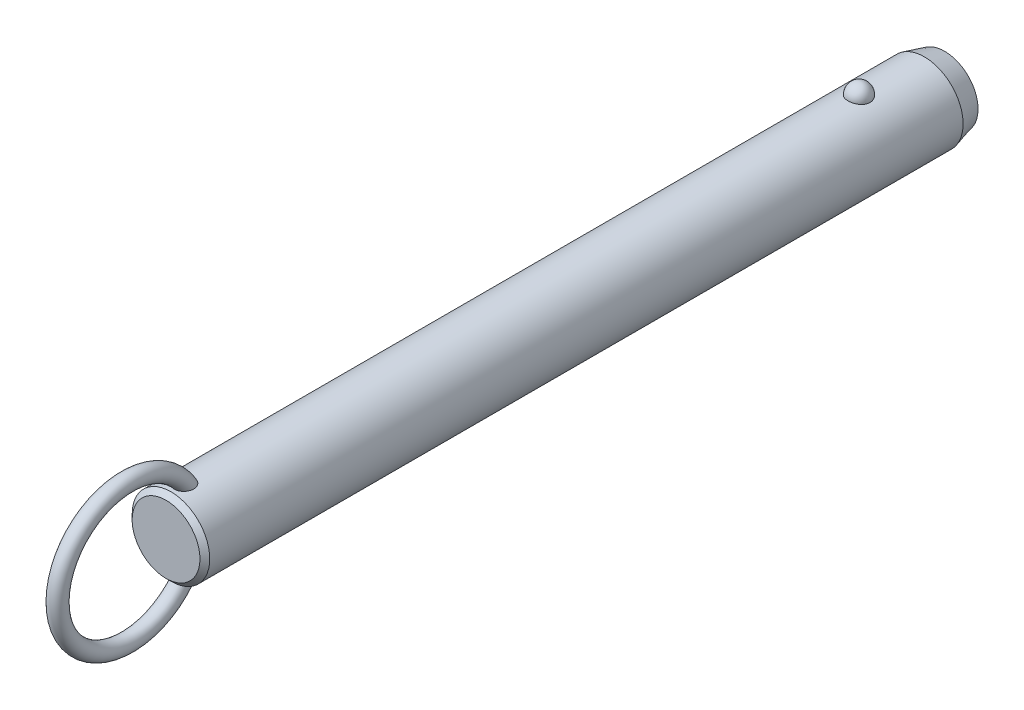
ISO-10303-21;
HEADER;
FILE_DESCRIPTION(('STEP AP214'),'2;1');
FILE_NAME('part.step','',(''),(''),'','','');
FILE_SCHEMA(('AUTOMOTIVE_DESIGN { 1 0 10303 214 1 1 1 1 }'));
ENDSEC;
DATA;
#1=APPLICATION_CONTEXT('core data for automotive mechanical design processes');
#2=APPLICATION_PROTOCOL_DEFINITION('international standard','automotive_design',2000,#1);
#3=PRODUCT_CONTEXT('',#1,'mechanical');
#4=PRODUCT('Part','Part','',(#3));
#5=PRODUCT_RELATED_PRODUCT_CATEGORY('part','',(#4));
#6=PRODUCT_DEFINITION_FORMATION('','',#4);
#7=PRODUCT_DEFINITION_CONTEXT('part definition',#1,'design');
#8=PRODUCT_DEFINITION('design','',#6,#7);
#9=PRODUCT_DEFINITION_SHAPE('','',#8);
#10=(LENGTH_UNIT() NAMED_UNIT(*) SI_UNIT(.MILLI.,.METRE.));
#11=(NAMED_UNIT(*) PLANE_ANGLE_UNIT() SI_UNIT($,.RADIAN.));
#12=(NAMED_UNIT(*) SI_UNIT($,.STERADIAN.) SOLID_ANGLE_UNIT());
#13=UNCERTAINTY_MEASURE_WITH_UNIT(LENGTH_MEASURE(1.E-05),#10,'distance_accuracy_value','');
#14=(GEOMETRIC_REPRESENTATION_CONTEXT(3) GLOBAL_UNCERTAINTY_ASSIGNED_CONTEXT((#13)) GLOBAL_UNIT_ASSIGNED_CONTEXT((#10,
#11,#12)) REPRESENTATION_CONTEXT('',''));
#15=CARTESIAN_POINT('',(0.,0.,0.));
#16=DIRECTION('',(0.,0.,1.));
#17=DIRECTION('',(1.,0.,0.));
#18=AXIS2_PLACEMENT_3D('',#15,#16,#17);
#19=CARTESIAN_POINT('',(0.,0.,157.5));
#20=DIRECTION('',(0.,0.,-1.));
#21=DIRECTION('',(-1.,0.,0.));
#22=AXIS2_PLACEMENT_3D('',#19,#20,#21);
#23=CYLINDRICAL_SURFACE('',#22,9.5);
#24=CARTESIAN_POINT('',(2.67259918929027,9.11631578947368,-2.70000000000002));
#25=CARTESIAN_POINT('',(2.6725968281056,9.11631786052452,-2.54909854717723));
#26=CARTESIAN_POINT('',(2.66030567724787,9.11994722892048,-2.39816735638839));
#27=CARTESIAN_POINT('',(2.6114347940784,9.13405924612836,-2.10058568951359));
#28=CARTESIAN_POINT('',(2.57484658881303,9.14454428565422,-1.95393672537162));
#29=CARTESIAN_POINT('',(2.47830875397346,9.17117631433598,-1.66916069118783));
#30=CARTESIAN_POINT('',(2.41836936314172,9.18732082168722,-1.53102991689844));
#31=CARTESIAN_POINT('',(2.27661331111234,9.22346780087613,-1.26705393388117));
#32=CARTESIAN_POINT('',(2.19479699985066,9.24347021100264,-1.14120852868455));
#33=CARTESIAN_POINT('',(2.01085282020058,9.28522401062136,-0.904632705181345));
#34=CARTESIAN_POINT('',(1.90862396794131,9.30698376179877,-0.793982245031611));
#35=CARTESIAN_POINT('',(1.6867437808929,9.34973971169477,-0.59160721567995));
#36=CARTESIAN_POINT('',(1.56709244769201,9.37073591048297,-0.499882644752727));
#37=CARTESIAN_POINT('',(1.31393976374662,9.40956370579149,-0.338167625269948));
#38=CARTESIAN_POINT('',(1.18048026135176,9.42740444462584,-0.268113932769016));
#39=CARTESIAN_POINT('',(0.903154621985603,9.45799906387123,-0.151390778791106));
#40=CARTESIAN_POINT('',(0.759289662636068,9.47075351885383,-0.104718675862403));
#41=CARTESIAN_POINT('',(0.468074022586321,9.48956256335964,-0.0367633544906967));
#42=CARTESIAN_POINT('',(0.320836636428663,9.49573643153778,-0.0150275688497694));
#43=CARTESIAN_POINT('',(0.0246714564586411,9.50112183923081,0.00396199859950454));
#44=CARTESIAN_POINT('',(-0.124256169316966,9.50033406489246,0.00121819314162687));
#45=CARTESIAN_POINT('',(-0.417264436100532,9.4919475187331,-0.0284441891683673));
#46=CARTESIAN_POINT('',(-0.56138413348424,9.48444885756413,-0.0550074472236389));
#47=CARTESIAN_POINT('',(-0.842986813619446,9.46357853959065,-0.131064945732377));
#48=CARTESIAN_POINT('',(-0.980469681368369,9.450206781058,-0.180559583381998));
#49=CARTESIAN_POINT('',(-1.24585005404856,9.41890822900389,-0.301476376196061));
#50=CARTESIAN_POINT('',(-1.37368611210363,9.40095498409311,-0.373026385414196));
#51=CARTESIAN_POINT('',(-1.61552738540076,9.36242964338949,-0.536025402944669));
#52=CARTESIAN_POINT('',(-1.72953116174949,9.34185727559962,-0.627476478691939));
#53=CARTESIAN_POINT('',(-1.9429225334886,9.29984568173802,-0.829844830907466));
#54=CARTESIAN_POINT('',(-2.04198021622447,9.27839736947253,-0.941108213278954));
#55=CARTESIAN_POINT('',(-2.22026460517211,9.23735994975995,-1.17883414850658));
#56=CARTESIAN_POINT('',(-2.29948985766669,9.21777097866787,-1.30529781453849));
#57=CARTESIAN_POINT('',(-2.43697287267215,9.18238994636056,-1.57158566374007));
#58=CARTESIAN_POINT('',(-2.49497068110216,9.16664569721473,-1.71155057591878));
#59=CARTESIAN_POINT('',(-2.5872073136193,9.14104303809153,-1.99961197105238));
#60=CARTESIAN_POINT('',(-2.62144683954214,9.13118445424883,-2.1477082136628));
#61=CARTESIAN_POINT('',(-2.66521466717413,9.11850622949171,-2.44715424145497));
#62=CARTESIAN_POINT('',(-2.67484831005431,9.11565658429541,-2.59848735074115));
#63=CARTESIAN_POINT('',(-2.66946735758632,9.11723375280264,-2.90067317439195));
#64=CARTESIAN_POINT('',(-2.65445345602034,9.12166036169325,-3.05152590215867));
#65=CARTESIAN_POINT('',(-2.60029711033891,9.13724422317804,-3.34766110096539));
#66=CARTESIAN_POINT('',(-2.56127978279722,9.14836656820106,-3.49296833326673));
#67=CARTESIAN_POINT('',(-2.46018844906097,9.17606676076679,-3.77477535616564));
#68=CARTESIAN_POINT('',(-2.39811349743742,9.1926448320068,-3.91127478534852));
#69=CARTESIAN_POINT('',(-2.25202303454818,9.22952198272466,-4.17244273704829));
#70=CARTESIAN_POINT('',(-2.16788714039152,9.24984129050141,-4.29704106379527));
#71=CARTESIAN_POINT('',(-1.9799408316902,9.29188255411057,-4.53013066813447));
#72=CARTESIAN_POINT('',(-1.87612963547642,9.31360456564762,-4.63862130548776));
#73=CARTESIAN_POINT('',(-1.65105429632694,9.35612959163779,-4.83690299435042));
#74=CARTESIAN_POINT('',(-1.52972405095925,9.37692871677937,-4.9266199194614));
#75=CARTESIAN_POINT('',(-1.27318250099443,9.41518970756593,-5.08429106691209));
#76=CARTESIAN_POINT('',(-1.13797219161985,9.432651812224,-5.15224684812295));
#77=CARTESIAN_POINT('',(-0.859280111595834,9.46208255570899,-5.26371827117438));
#78=CARTESIAN_POINT('',(-0.715925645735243,9.47411833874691,-5.30753421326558));
#79=CARTESIAN_POINT('',(-0.423550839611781,9.4916822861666,-5.37076321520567));
#80=CARTESIAN_POINT('',(-0.2745312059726,9.49721125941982,-5.39017930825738));
#81=CARTESIAN_POINT('',(0.0218446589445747,9.50110860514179,-5.40390587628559));
#82=CARTESIAN_POINT('',(0.16917707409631,9.49961381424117,-5.39869609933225));
#83=CARTESIAN_POINT('',(0.460808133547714,9.48993906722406,-5.36441955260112));
#84=CARTESIAN_POINT('',(0.605106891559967,9.48175936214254,-5.33535367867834));
#85=CARTESIAN_POINT('',(0.886027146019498,9.4596376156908,-5.25435587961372));
#86=CARTESIAN_POINT('',(1.02267710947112,9.44571881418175,-5.20251612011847));
#87=CARTESIAN_POINT('',(1.28523827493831,9.41358993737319,-5.07741549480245));
#88=CARTESIAN_POINT('',(1.41114877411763,9.39537958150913,-5.00415322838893));
#89=CARTESIAN_POINT('',(1.65085227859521,9.3562644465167,-4.83684599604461));
#90=CARTESIAN_POINT('',(1.76442346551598,9.33532178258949,-4.74249218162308));
#91=CARTESIAN_POINT('',(1.97425672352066,9.29321198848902,-4.53620389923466));
#92=CARTESIAN_POINT('',(2.07051582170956,9.27204482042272,-4.42426641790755));
#93=CARTESIAN_POINT('',(2.24490086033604,9.23139221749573,-4.18363183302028));
#94=CARTESIAN_POINT('',(2.32267019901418,9.21194380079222,-4.05466990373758));
#95=CARTESIAN_POINT('',(2.45584092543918,9.1773419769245,-3.78517836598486));
#96=CARTESIAN_POINT('',(2.5112497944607,9.16218713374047,-3.644652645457));
#97=CARTESIAN_POINT('',(2.59380876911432,9.13913522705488,-3.37104301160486));
#98=CARTESIAN_POINT('',(2.62330266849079,9.13064624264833,-3.23871053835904));
#99=CARTESIAN_POINT('',(2.66269870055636,9.11923566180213,-2.97092664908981));
#100=CARTESIAN_POINT('',(2.67260130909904,9.11631393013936,-2.83547530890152));
#101=CARTESIAN_POINT('',(2.67259918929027,9.11631578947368,-2.70000000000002));
#102=B_SPLINE_CURVE_WITH_KNOTS('',3,(#24,#25,#26,#27,#28,#29,#30,#31,#32,#33,#34,#35,#36,#37,
#38,#39,#40,#41,#42,#43,#44,#45,#46,#47,#48,#49,#50,#51,#52,#53,#54,#55,#56,#57,#58,#59,#60,#61,
#62,#63,#64,#65,#66,#67,#68,#69,#70,#71,#72,#73,#74,#75,#76,#77,#78,#79,#80,#81,#82,#83,#84,#85,
#86,#87,#88,#89,#90,#91,#92,#93,#94,#95,#96,#97,#98,#99,#100,#101),.UNSPECIFIED.,.T.,.F.,(4,2,2,
2,2,2,2,2,2,2,2,2,2,2,2,2,2,2,2,2,2,2,2,2,2,2,2,2,2,2,2,2,2,2,2,2,2,2,4),(0.,0.452217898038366,
0.904593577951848,1.35677112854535,1.80894144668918,2.26340676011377,2.71787203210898,
3.17099820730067,3.62407318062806,4.0687883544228,4.51345969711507,4.95160616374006,
5.38976021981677,5.83050358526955,6.27129275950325,6.72071308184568,7.17016633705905,
7.62495278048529,8.07972578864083,8.53254856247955,8.98535859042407,9.43582813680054,
9.88631615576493,10.3393155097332,10.7923328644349,11.2471065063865,11.7018475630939,
12.150795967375,12.599688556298,13.0398725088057,13.4800399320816,13.9184421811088,
14.3568730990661,14.802202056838,15.2476074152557,15.7010097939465,16.1542603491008,
16.5602594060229,16.966248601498),.UNSPECIFIED.);
#103=CARTESIAN_POINT('',(2.67259918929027,9.11631578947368,-2.70000000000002));
#104=VERTEX_POINT('',#103);
#105=EDGE_CURVE('E41',#104,#104,#102,.T.);
#106=ORIENTED_EDGE('',*,*,#105,.T.);
#107=EDGE_LOOP('',(#106));
#108=FACE_BOUND('',#107,.T.);
#109=CARTESIAN_POINT('',(0.,0.,165.82));
#110=DIRECTION('',(0.,0.,1.));
#111=DIRECTION('',(1.,0.,0.));
#112=AXIS2_PLACEMENT_3D('',#109,#110,#111);
#113=CIRCLE('',#112,9.5);
#114=CARTESIAN_POINT('',(9.5,0.,165.82));
#115=VERTEX_POINT('',#114);
#116=EDGE_CURVE('E10',#115,#115,#113,.F.);
#117=ORIENTED_EDGE('',*,*,#116,.T.);
#118=EDGE_LOOP('',(#117));
#119=FACE_BOUND('',#118,.T.);
#120=CARTESIAN_POINT('',(-0.697062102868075,-9.47439269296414,160.167808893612));
#121=CARTESIAN_POINT('',(-0.799579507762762,-9.46685146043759,160.207482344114));
#122=CARTESIAN_POINT('',(-0.89857563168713,-9.45788043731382,160.2559309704));
#123=CARTESIAN_POINT('',(-1.08670047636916,-9.43811593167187,160.368868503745));
#124=CARTESIAN_POINT('',(-1.17583204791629,-9.42732297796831,160.433352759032));
#125=CARTESIAN_POINT('',(-1.34179806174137,-9.40513672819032,160.576209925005));
#126=CARTESIAN_POINT('',(-1.41865133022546,-9.39374438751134,160.654561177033));
#127=CARTESIAN_POINT('',(-1.5586004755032,-9.37154196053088,160.822752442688));
#128=CARTESIAN_POINT('',(-1.62169476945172,-9.3607319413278,160.91259377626));
#129=CARTESIAN_POINT('',(-1.73527695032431,-9.34035749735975,161.104500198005));
#130=CARTESIAN_POINT('',(-1.78522266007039,-9.33085270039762,161.206891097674));
#131=CARTESIAN_POINT('',(-1.86924997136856,-9.3143834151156,161.418148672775));
#132=CARTESIAN_POINT('',(-1.90332570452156,-9.30741986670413,161.527017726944));
#133=CARTESIAN_POINT('',(-1.95893603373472,-9.29588482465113,161.760473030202));
#134=CARTESIAN_POINT('',(-1.97872420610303,-9.29165182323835,161.885489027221));
#135=CARTESIAN_POINT('',(-2.00062129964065,-9.28695978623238,162.137080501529));
#136=CARTESIAN_POINT('',(-2.00272284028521,-9.28650232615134,162.263656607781));
#137=CARTESIAN_POINT('',(-1.98958876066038,-9.28932750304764,162.536815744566));
#138=CARTESIAN_POINT('',(-1.97143366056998,-9.2932400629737,162.683251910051));
#139=CARTESIAN_POINT('',(-1.91479925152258,-9.30507151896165,162.972062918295));
#140=CARTESIAN_POINT('',(-1.87629122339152,-9.31299607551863,163.114431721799));
#141=CARTESIAN_POINT('',(-1.7722568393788,-9.33340232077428,163.415172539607));
#142=CARTESIAN_POINT('',(-1.70334898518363,-9.34641636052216,163.572369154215));
#143=CARTESIAN_POINT('',(-1.58111062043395,-9.36759153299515,163.797517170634));
#144=CARTESIAN_POINT('',(-1.53721459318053,-9.3749261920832,163.870796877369));
#145=CARTESIAN_POINT('',(-1.44302631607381,-9.38988566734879,164.01307405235));
#146=CARTESIAN_POINT('',(-1.39273721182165,-9.39751033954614,164.082073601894));
#147=CARTESIAN_POINT('',(-1.26775962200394,-9.41530678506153,164.236983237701));
#148=CARTESIAN_POINT('',(-1.19052326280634,-9.42548108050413,164.320871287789));
#149=CARTESIAN_POINT('',(-1.0242024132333,-9.44499825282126,164.476008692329));
#150=CARTESIAN_POINT('',(-0.935139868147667,-9.45434261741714,164.547280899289));
#151=CARTESIAN_POINT('',(-0.766610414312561,-9.46930670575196,164.658695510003));
#152=CARTESIAN_POINT('',(-0.689439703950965,-9.47529223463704,164.702235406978));
#153=CARTESIAN_POINT('',(-0.52894200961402,-9.48560294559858,164.77631336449));
#154=CARTESIAN_POINT('',(-0.445620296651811,-9.48992953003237,164.806862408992));
#155=CARTESIAN_POINT('',(-0.273901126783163,-9.49644161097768,164.852579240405));
#156=CARTESIAN_POINT('',(-0.18546574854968,-9.49860811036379,164.86761059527));
#157=CARTESIAN_POINT('',(-0.00734541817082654,-9.5004135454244,164.880149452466));
#158=CARTESIAN_POINT('',(0.082338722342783,-9.50005405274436,164.877667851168));
#159=CARTESIAN_POINT('',(0.247679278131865,-9.49708301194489,164.856995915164));
#160=CARTESIAN_POINT('',(0.323620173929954,-9.49477609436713,164.840930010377));
#161=CARTESIAN_POINT('',(0.471981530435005,-9.48855917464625,164.797172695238));
#162=CARTESIAN_POINT('',(0.544400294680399,-9.48464840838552,164.769475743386));
#163=CARTESIAN_POINT('',(0.708947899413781,-9.47398336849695,164.69280266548));
#164=CARTESIAN_POINT('',(0.799149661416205,-9.46671310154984,164.639774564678));
#165=CARTESIAN_POINT('',(0.969783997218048,-9.45076225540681,164.519973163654));
#166=CARTESIAN_POINT('',(1.05019415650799,-9.44207854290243,164.453169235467));
#167=CARTESIAN_POINT('',(1.23092343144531,-9.42051459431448,164.280759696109));
#168=CARTESIAN_POINT('',(1.32652499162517,-9.40733378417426,164.17026193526));
#169=CARTESIAN_POINT('',(1.49893121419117,-9.38140745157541,163.935561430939));
#170=CARTESIAN_POINT('',(1.57571616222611,-9.36866239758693,163.811344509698));
#171=CARTESIAN_POINT('',(1.71285426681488,-9.34457644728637,163.549389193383));
#172=CARTESIAN_POINT('',(1.77266365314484,-9.33328726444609,163.41136233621));
#173=CARTESIAN_POINT('',(1.87239208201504,-9.31379209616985,163.128051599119));
#174=CARTESIAN_POINT('',(1.91230158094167,-9.30558759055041,162.982764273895));
#175=CARTESIAN_POINT('',(1.97604189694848,-9.29228394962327,162.662028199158));
#176=CARTESIAN_POINT('',(1.9958743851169,-9.28797202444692,162.485724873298));
#177=CARTESIAN_POINT('',(2.00295708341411,-9.28645519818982,162.132414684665));
#178=CARTESIAN_POINT('',(1.99025930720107,-9.28923895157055,161.955409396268));
#179=CARTESIAN_POINT('',(1.93735479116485,-9.30038134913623,161.656338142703));
#180=CARTESIAN_POINT('',(1.90576827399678,-9.30697680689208,161.532667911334));
#181=CARTESIAN_POINT('',(1.82287484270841,-9.32356855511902,161.292329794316));
#182=CARTESIAN_POINT('',(1.77158213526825,-9.33356239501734,161.175656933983));
#183=CARTESIAN_POINT('',(1.64885744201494,-9.35602275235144,160.952706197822));
#184=CARTESIAN_POINT('',(1.57730995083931,-9.36850332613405,160.846492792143));
#185=CARTESIAN_POINT('',(1.41543264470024,-9.39431873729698,160.649553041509));
#186=CARTESIAN_POINT('',(1.32510883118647,-9.40765330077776,160.558821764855));
#187=CARTESIAN_POINT('',(1.13846223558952,-9.43195720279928,160.405033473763));
#188=CARTESIAN_POINT('',(1.04369890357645,-9.44302894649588,160.340094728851));
#189=CARTESIAN_POINT('',(0.843965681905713,-9.46296805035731,160.228038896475));
#190=CARTESIAN_POINT('',(0.739000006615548,-9.47183631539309,160.180914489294));
#191=CARTESIAN_POINT('',(0.528175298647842,-9.48586140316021,160.108117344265));
#192=CARTESIAN_POINT('',(0.422686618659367,-9.49119633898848,160.08140249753));
#193=CARTESIAN_POINT('',(0.208590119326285,-9.49831365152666,160.046013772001));
#194=CARTESIAN_POINT('',(0.0999817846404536,-9.500095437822,160.037342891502));
#195=CARTESIAN_POINT('',(-0.126104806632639,-9.49988861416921,160.038350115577));
#196=CARTESIAN_POINT('',(-0.243578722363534,-9.49757821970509,160.049594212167));
#197=CARTESIAN_POINT('',(-0.474390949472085,-9.48885165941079,160.093167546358));
#198=CARTESIAN_POINT('',(-0.587729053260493,-9.48243528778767,160.125497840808));
#199=CARTESIAN_POINT('',(-0.697062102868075,-9.47439269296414,160.167808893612));
#200=B_SPLINE_CURVE_WITH_KNOTS('',3,(#120,#121,#122,#123,#124,#125,#126,#127,#128,#129,#130,
#131,#132,#133,#134,#135,#136,#137,#138,#139,#140,#141,#142,#143,#144,#145,#146,#147,#148,#149,
#150,#151,#152,#153,#154,#155,#156,#157,#158,#159,#160,#161,#162,#163,#164,#165,#166,#167,#168,
#169,#170,#171,#172,#173,#174,#175,#176,#177,#178,#179,#180,#181,#182,#183,#184,#185,#186,#187,
#188,#189,#190,#191,#192,#193,#194,#195,#196,#197,#198,#199),.UNSPECIFIED.,.T.,.F.,(4,2,2,2,2,2,
2,2,2,2,2,2,2,2,2,2,2,2,2,2,2,2,2,2,2,2,2,2,2,2,2,2,2,2,2,2,2,2,2,4),(0.,0.330119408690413,
0.6601431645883,0.98965593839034,1.31920659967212,1.66074728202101,2.00241415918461,
2.38088696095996,2.75951768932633,3.20065679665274,3.64242004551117,4.15620996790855,
4.4131416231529,4.66994734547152,5.01228664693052,5.35399933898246,5.61943037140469,
5.88463652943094,6.15215502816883,6.41950709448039,6.65144391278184,6.88349136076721,
7.19641200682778,7.51003602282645,7.94779711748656,8.3860149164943,8.83699707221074,
9.28819530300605,9.81778662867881,10.34653170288,10.7284172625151,11.1100280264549,
11.4938603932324,11.8775702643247,12.2220189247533,12.5663259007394,12.8915939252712,
13.2169159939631,13.5689650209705,13.9210316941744),.UNSPECIFIED.);
#201=CARTESIAN_POINT('',(-0.697062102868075,-9.47439269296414,160.167808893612));
#202=VERTEX_POINT('',#201);
#203=EDGE_CURVE('E60',#202,#202,#200,.T.);
#204=ORIENTED_EDGE('',*,*,#203,.T.);
#205=EDGE_LOOP('',(#204));
#206=FACE_BOUND('',#205,.T.);
#207=CARTESIAN_POINT('',(-0.697062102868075,9.47439269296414,160.167808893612));
#208=CARTESIAN_POINT('',(-0.597792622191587,9.48169483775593,160.12939564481));
#209=CARTESIAN_POINT('',(-0.495106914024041,9.48766580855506,160.099168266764));
#210=CARTESIAN_POINT('',(-0.285876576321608,9.49627648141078,160.056032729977));
#211=CARTESIAN_POINT('',(-0.179324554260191,9.49890941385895,160.043159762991));
#212=CARTESIAN_POINT('',(0.0344157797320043,9.50053798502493,160.035166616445));
#213=CARTESIAN_POINT('',(0.14160360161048,9.49953613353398,160.040034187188));
#214=CARTESIAN_POINT('',(0.353563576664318,9.49401038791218,160.067365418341));
#215=CARTESIAN_POINT('',(0.458336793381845,9.48948807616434,160.08982117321));
#216=CARTESIAN_POINT('',(0.662493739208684,9.4774236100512,160.151671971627));
#217=CARTESIAN_POINT('',(0.761881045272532,9.46988348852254,160.191055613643));
#218=CARTESIAN_POINT('',(0.952608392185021,9.45260382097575,160.285634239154));
#219=CARTESIAN_POINT('',(1.04394806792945,9.44286417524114,160.340829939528));
#220=CARTESIAN_POINT('',(1.21712767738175,9.42211760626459,160.466066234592));
#221=CARTESIAN_POINT('',(1.29885671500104,9.41109835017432,160.536257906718));
#222=CARTESIAN_POINT('',(1.44978975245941,9.38903310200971,160.688980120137));
#223=CARTESIAN_POINT('',(1.51899278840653,9.37798710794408,160.771511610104));
#224=CARTESIAN_POINT('',(1.64602857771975,9.35654375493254,160.949776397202));
#225=CARTESIAN_POINT('',(1.70333052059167,9.34618688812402,161.045891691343));
#226=CARTESIAN_POINT('',(1.80259341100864,9.32755128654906,161.245897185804));
#227=CARTESIAN_POINT('',(1.84454942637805,9.31927322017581,161.349789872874));
#228=CARTESIAN_POINT('',(1.91637039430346,9.30478365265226,161.572213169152));
#229=CARTESIAN_POINT('',(1.944805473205,9.29882552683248,161.691219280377));
#230=CARTESIAN_POINT('',(1.98449865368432,9.29043398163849,161.932143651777));
#231=CARTESIAN_POINT('',(1.99574908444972,9.28800213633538,162.054063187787));
#232=CARTESIAN_POINT('',(2.00275141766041,9.28649645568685,162.316932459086));
#233=CARTESIAN_POINT('',(1.99588238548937,9.28799035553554,162.457952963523));
#234=CARTESIAN_POINT('',(1.96270559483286,9.29505517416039,162.737621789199));
#235=CARTESIAN_POINT('',(1.93637872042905,9.30063010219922,162.876267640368));
#236=CARTESIAN_POINT('',(1.85949176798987,9.31633564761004,163.172561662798));
#237=CARTESIAN_POINT('',(1.80549792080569,9.3270926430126,163.329290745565));
#238=CARTESIAN_POINT('',(1.67376869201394,9.3516306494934,163.632284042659));
#239=CARTESIAN_POINT('',(1.59603181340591,9.36541185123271,163.778547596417));
#240=CARTESIAN_POINT('',(1.4360277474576,9.39110706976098,164.025813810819));
#241=CARTESIAN_POINT('',(1.35831795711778,9.40278656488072,164.129791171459));
#242=CARTESIAN_POINT('',(1.18774483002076,9.42585025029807,164.324534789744));
#243=CARTESIAN_POINT('',(1.09490932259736,9.43723493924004,164.415324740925));
#244=CARTESIAN_POINT('',(0.921110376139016,9.45552616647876,164.55620334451));
#245=CARTESIAN_POINT('',(0.843738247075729,9.46281058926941,164.610656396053));
#246=CARTESIAN_POINT('',(0.681245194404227,9.47589120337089,164.706711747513));
#247=CARTESIAN_POINT('',(0.596135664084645,9.48168953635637,164.748332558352));
#248=CARTESIAN_POINT('',(0.433779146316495,9.49038144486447,164.810089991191));
#249=CARTESIAN_POINT('',(0.35745955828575,9.49359170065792,164.83260136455));
#250=CARTESIAN_POINT('',(0.202074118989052,9.49816761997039,164.864574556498));
#251=CARTESIAN_POINT('',(0.123010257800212,9.49953459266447,164.874045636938));
#252=CARTESIAN_POINT('',(-0.0357372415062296,9.50026497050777,164.879114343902));
#253=CARTESIAN_POINT('',(-0.115421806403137,9.49962433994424,164.874684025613));
#254=CARTESIAN_POINT('',(-0.272823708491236,9.49640854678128,164.852296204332));
#255=CARTESIAN_POINT('',(-0.350540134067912,9.4938325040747,164.834332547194));
#256=CARTESIAN_POINT('',(-0.500580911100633,9.48709462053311,164.786802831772));
#257=CARTESIAN_POINT('',(-0.572979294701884,9.48296359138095,164.757461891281));
#258=CARTESIAN_POINT('',(-0.712864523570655,9.47347609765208,164.689008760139));
#259=CARTESIAN_POINT('',(-0.780349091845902,9.46811906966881,164.649892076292));
#260=CARTESIAN_POINT('',(-0.946309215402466,9.45329720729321,164.539432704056));
#261=CARTESIAN_POINT('',(-1.04090230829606,9.44321512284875,164.462329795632));
#262=CARTESIAN_POINT('',(-1.21661929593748,9.42219227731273,164.29409718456));
#263=CARTESIAN_POINT('',(-1.29770519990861,9.41124921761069,164.202929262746));
#264=CARTESIAN_POINT('',(-1.47319646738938,9.38563439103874,163.976162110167));
#265=CARTESIAN_POINT('',(-1.5620887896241,9.37102009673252,163.836289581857));
#266=CARTESIAN_POINT('',(-1.71623987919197,9.34401559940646,163.543950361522));
#267=CARTESIAN_POINT('',(-1.7814786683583,9.33162728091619,163.391473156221));
#268=CARTESIAN_POINT('',(-1.88853837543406,9.31055541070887,163.075647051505));
#269=CARTESIAN_POINT('',(-1.92998995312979,9.30193076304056,162.912168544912));
#270=CARTESIAN_POINT('',(-1.98590726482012,9.29015757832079,162.580526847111));
#271=CARTESIAN_POINT('',(-2.0004070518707,9.2870021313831,162.412369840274));
#272=CARTESIAN_POINT('',(-1.99964701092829,9.28716218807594,162.105080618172));
#273=CARTESIAN_POINT('',(-1.98908145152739,9.28945704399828,161.965936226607));
#274=CARTESIAN_POINT('',(-1.94566294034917,9.29865169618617,161.691153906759));
#275=CARTESIAN_POINT('',(-1.91282062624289,9.30554929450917,161.555514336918));
#276=CARTESIAN_POINT('',(-1.84582133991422,9.31898248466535,161.357802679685));
#277=CARTESIAN_POINT('',(-1.82038084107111,9.32400364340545,161.292583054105));
#278=CARTESIAN_POINT('',(-1.7635051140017,9.33492884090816,161.164903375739));
#279=CARTESIAN_POINT('',(-1.73207305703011,9.34083241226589,161.102441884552));
#280=CARTESIAN_POINT('',(-1.66324243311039,9.35333332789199,160.98094078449));
#281=CARTESIAN_POINT('',(-1.625842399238,9.35993084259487,160.921902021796));
#282=CARTESIAN_POINT('',(-1.54527678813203,9.37356864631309,160.807987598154));
#283=CARTESIAN_POINT('',(-1.50211241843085,9.38060884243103,160.753111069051));
#284=CARTESIAN_POINT('',(-1.37681147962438,9.40004442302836,160.609961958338));
#285=CARTESIAN_POINT('',(-1.28916358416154,9.41261047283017,160.526429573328));
#286=CARTESIAN_POINT('',(-1.09996826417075,9.43658180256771,160.377236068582));
#287=CARTESIAN_POINT('',(-0.998461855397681,9.44799034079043,160.311523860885));
#288=CARTESIAN_POINT('',(-0.860188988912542,9.46103017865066,160.2394367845));
#289=CARTESIAN_POINT('',(-0.828141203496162,9.46389141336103,160.223851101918));
#290=CARTESIAN_POINT('',(-0.763210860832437,9.46934915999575,160.194473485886));
#291=CARTESIAN_POINT('',(-0.730328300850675,9.47194567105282,160.180681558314));
#292=CARTESIAN_POINT('',(-0.697062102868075,9.47439269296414,160.167808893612));
#293=B_SPLINE_CURVE_WITH_KNOTS('',3,(#207,#208,#209,#210,#211,#212,#213,#214,#215,#216,#217,
#218,#219,#220,#221,#222,#223,#224,#225,#226,#227,#228,#229,#230,#231,#232,#233,#234,#235,#236,
#237,#238,#239,#240,#241,#242,#243,#244,#245,#246,#247,#248,#249,#250,#251,#252,#253,#254,#255,
#256,#257,#258,#259,#260,#261,#262,#263,#264,#265,#266,#267,#268,#269,#270,#271,#272,#273,#274,
#275,#276,#277,#278,#279,#280,#281,#282,#283,#284,#285,#286,#287,#288,#289,#290,#291,#292),
.UNSPECIFIED.,.T.,.F.,(4,2,2,2,2,2,2,2,2,2,2,2,2,2,2,2,2,2,2,2,2,2,2,2,2,2,2,2,2,2,2,2,2,2,2,2,
2,2,2,2,2,2,4),(0.,0.319942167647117,0.640532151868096,0.960900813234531,1.28112555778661,
1.60113495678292,1.92115886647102,2.24457323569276,2.56801248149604,2.90371927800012,
3.23953387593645,3.60560313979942,3.97183576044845,4.39383693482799,4.81625324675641,
5.31257045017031,5.80891895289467,6.19868344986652,6.58773876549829,6.87145417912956,
7.15475838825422,7.3926375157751,7.63034760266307,7.86853584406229,8.10683246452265,
8.34063661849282,8.57454843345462,8.93983939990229,9.30614105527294,9.80266668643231,
10.2996107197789,10.8040753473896,11.3079021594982,11.7249776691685,12.1418541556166,
12.3521485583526,12.5623319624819,12.7725671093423,12.9827582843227,13.345827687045,
13.7078449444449,13.8150604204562,13.9222762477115),.UNSPECIFIED.);
#294=CARTESIAN_POINT('',(-0.697062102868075,9.47439269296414,160.167808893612));
#295=VERTEX_POINT('',#294);
#296=EDGE_CURVE('E68',#295,#295,#293,.T.);
#297=ORIENTED_EDGE('',*,*,#296,.T.);
#298=EDGE_LOOP('',(#297));
#299=FACE_BOUND('',#298,.T.);
#300=CARTESIAN_POINT('',(0.,0.,-18.6999999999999));
#301=DIRECTION('',(0.,0.,-1.));
#302=DIRECTION('',(-1.,0.,0.));
#303=AXIS2_PLACEMENT_3D('',#300,#301,#302);
#304=CIRCLE('',#303,9.5);
#305=CARTESIAN_POINT('',(-9.5,0.,-18.6999999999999));
#306=VERTEX_POINT('',#305);
#307=EDGE_CURVE('E57',#306,#306,#304,.F.);
#308=ORIENTED_EDGE('',*,*,#307,.T.);
#309=EDGE_LOOP('',(#308));
#310=FACE_BOUND('',#309,.T.);
#311=ADVANCED_FACE('F37',(#108,#119,#206,#299,#310),#23,.T.);
#312=CARTESIAN_POINT('',(0.,0.,-23.7));
#313=DIRECTION('',(0.,0.,-1.));
#314=DIRECTION('',(-1.,0.,0.));
#315=AXIS2_PLACEMENT_3D('',#312,#313,#314);
#316=PLANE('',#315);
#317=CARTESIAN_POINT('',(0.,0.,-23.7));
#318=DIRECTION('',(0.,0.,-1.));
#319=DIRECTION('',(-1.,0.,0.));
#320=AXIS2_PLACEMENT_3D('',#317,#318,#319);
#321=CIRCLE('',#320,8.16025403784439);
#322=CARTESIAN_POINT('',(-8.16025403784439,0.,-23.7));
#323=VERTEX_POINT('',#322);
#324=EDGE_CURVE('E67',#323,#323,#321,.T.);
#325=ORIENTED_EDGE('',*,*,#324,.T.);
#326=EDGE_LOOP('',(#325));
#327=FACE_BOUND('',#326,.T.);
#328=ADVANCED_FACE('F86',(#327),#316,.T.);
#329=CARTESIAN_POINT('',(0.,0.,-23.7));
#330=DIRECTION('',(0.,0.,1.));
#331=DIRECTION('',(1.,0.,0.));
#332=AXIS2_PLACEMENT_3D('',#329,#330,#331);
#333=CONICAL_SURFACE('',#332,8.16025403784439,0.261799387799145);
#334=ORIENTED_EDGE('',*,*,#307,.F.);
#335=EDGE_LOOP('',(#334));
#336=FACE_BOUND('',#335,.T.);
#337=ORIENTED_EDGE('',*,*,#324,.F.);
#338=EDGE_LOOP('',(#337));
#339=FACE_BOUND('',#338,.T.);
#340=ADVANCED_FACE('F84',(#336,#339),#333,.T.);
#341=CARTESIAN_POINT('',(0.,0.,167.02));
#342=DIRECTION('',(0.,0.,1.));
#343=DIRECTION('',(1.,0.,0.));
#344=AXIS2_PLACEMENT_3D('',#341,#342,#343);
#345=PLANE('',#344);
#346=CARTESIAN_POINT('',(0.,0.,167.02));
#347=DIRECTION('',(0.,0.,1.));
#348=DIRECTION('',(1.,0.,0.));
#349=AXIS2_PLACEMENT_3D('',#346,#347,#348);
#350=CIRCLE('',#349,8.30000000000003);
#351=CARTESIAN_POINT('',(8.30000000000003,0.,167.02));
#352=VERTEX_POINT('',#351);
#353=EDGE_CURVE('E50',#352,#352,#350,.T.);
#354=ORIENTED_EDGE('',*,*,#353,.T.);
#355=EDGE_LOOP('',(#354));
#356=FACE_BOUND('',#355,.T.);
#357=ADVANCED_FACE('F78',(#356),#345,.T.);
#358=CARTESIAN_POINT('',(0.,0.,176.55));
#359=DIRECTION('',(1.,0.,0.));
#360=DIRECTION('',(0.,0.,-1.));
#361=AXIS2_PLACEMENT_3D('',#358,#359,#360);
#362=TOROIDAL_SURFACE('',#361,17.05,2.);
#363=ORIENTED_EDGE('',*,*,#296,.F.);
#364=EDGE_LOOP('',(#363));
#365=FACE_BOUND('',#364,.T.);
#366=ORIENTED_EDGE('',*,*,#203,.F.);
#367=EDGE_LOOP('',(#366));
#368=FACE_BOUND('',#367,.T.);
#369=ADVANCED_FACE('F74',(#365,#368),#362,.T.);
#370=CARTESIAN_POINT('',(0.,0.,167.02));
#371=DIRECTION('',(0.,0.,-1.));
#372=DIRECTION('',(-1.,0.,0.));
#373=AXIS2_PLACEMENT_3D('',#370,#371,#372);
#374=CONICAL_SURFACE('',#373,8.30000000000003,0.785398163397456);
#375=ORIENTED_EDGE('',*,*,#116,.F.);
#376=EDGE_LOOP('',(#375));
#377=FACE_BOUND('',#376,.T.);
#378=ORIENTED_EDGE('',*,*,#353,.F.);
#379=EDGE_LOOP('',(#378));
#380=FACE_BOUND('',#379,.T.);
#381=ADVANCED_FACE('F39',(#377,#380),#374,.T.);
#382=CARTESIAN_POINT('',(0.,9.5,-2.70000000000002));
#383=DIRECTION('',(0.,1.,0.));
#384=DIRECTION('',(0.,0.,-1.));
#385=AXIS2_PLACEMENT_3D('',#382,#383,#384);
#386=SPHERICAL_SURFACE('',#385,2.7);
#387=ORIENTED_EDGE('',*,*,#105,.F.);
#388=EDGE_LOOP('',(#387));
#389=FACE_BOUND('',#388,.T.);
#390=ADVANCED_FACE('F80',(#389),#386,.T.);
#391=CLOSED_SHELL('',(#311,#328,#340,#357,#369,#381,#390));
#392=MANIFOLD_SOLID_BREP('B2',#391);
#393=ADVANCED_BREP_SHAPE_REPRESENTATION('',(#18,#392),#14);
#394=SHAPE_DEFINITION_REPRESENTATION(#9,#393);
ENDSEC;
END-ISO-10303-21;
